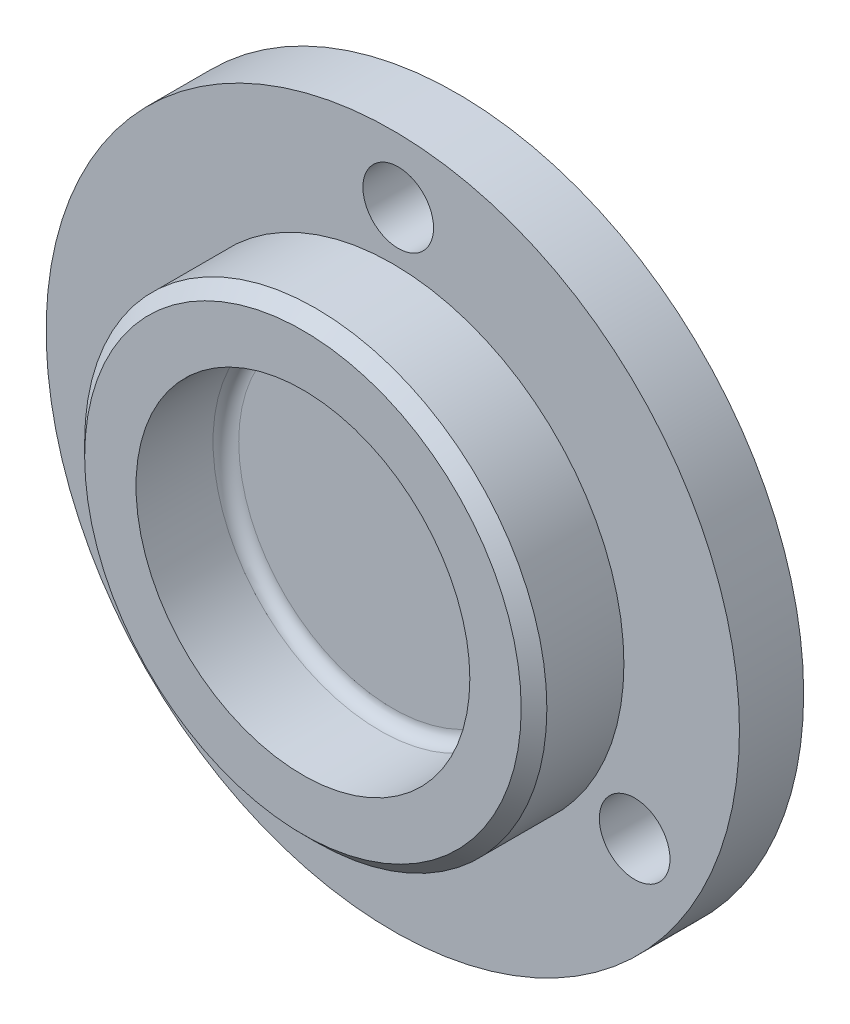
ISO-10303-21;
HEADER;
FILE_DESCRIPTION(('STEP AP214'),'2;1');
FILE_NAME('part.step','',(''),(''),'','','');
FILE_SCHEMA(('AUTOMOTIVE_DESIGN { 1 0 10303 214 1 1 1 1 }'));
ENDSEC;
DATA;
#1=APPLICATION_CONTEXT('core data for automotive mechanical design processes');
#2=APPLICATION_PROTOCOL_DEFINITION('international standard','automotive_design',2000,#1);
#3=PRODUCT_CONTEXT('',#1,'mechanical');
#4=PRODUCT('Part','Part','',(#3));
#5=PRODUCT_RELATED_PRODUCT_CATEGORY('part','',(#4));
#6=PRODUCT_DEFINITION_FORMATION('','',#4);
#7=PRODUCT_DEFINITION_CONTEXT('part definition',#1,'design');
#8=PRODUCT_DEFINITION('design','',#6,#7);
#9=PRODUCT_DEFINITION_SHAPE('','',#8);
#10=(LENGTH_UNIT() NAMED_UNIT(*) SI_UNIT(.MILLI.,.METRE.));
#11=(NAMED_UNIT(*) PLANE_ANGLE_UNIT() SI_UNIT($,.RADIAN.));
#12=(NAMED_UNIT(*) SI_UNIT($,.STERADIAN.) SOLID_ANGLE_UNIT());
#13=UNCERTAINTY_MEASURE_WITH_UNIT(LENGTH_MEASURE(1.E-05),#10,'distance_accuracy_value','');
#14=(GEOMETRIC_REPRESENTATION_CONTEXT(3) GLOBAL_UNCERTAINTY_ASSIGNED_CONTEXT((#13)) GLOBAL_UNIT_ASSIGNED_CONTEXT((#10,
#11,#12)) REPRESENTATION_CONTEXT('',''));
#15=CARTESIAN_POINT('',(0.,0.,0.));
#16=DIRECTION('',(0.,0.,1.));
#17=DIRECTION('',(1.,0.,0.));
#18=AXIS2_PLACEMENT_3D('',#15,#16,#17);
#19=CARTESIAN_POINT('',(0.,0.,5.));
#20=DIRECTION('',(0.,0.,1.));
#21=DIRECTION('',(1.,0.,0.));
#22=AXIS2_PLACEMENT_3D('',#19,#20,#21);
#23=PLANE('',#22);
#24=CARTESIAN_POINT('',(-19.260536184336,-10.6316389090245,5.));
#25=DIRECTION('',(0.,0.,1.));
#26=DIRECTION('',(1.,0.,0.));
#27=AXIS2_PLACEMENT_3D('',#24,#25,#26);
#28=CIRCLE('',#27,2.75);
#29=CARTESIAN_POINT('',(-16.510536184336,-10.6316389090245,5.));
#30=VERTEX_POINT('',#29);
#31=EDGE_CURVE('E73',#30,#30,#28,.T.);
#32=ORIENTED_EDGE('',*,*,#31,.F.);
#33=EDGE_LOOP('',(#32));
#34=FACE_BOUND('',#33,.T.);
#35=CARTESIAN_POINT('',(18.8375374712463,-11.3642941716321,5.));
#36=DIRECTION('',(0.,0.,1.));
#37=DIRECTION('',(1.,0.,0.));
#38=AXIS2_PLACEMENT_3D('',#35,#36,#37);
#39=CIRCLE('',#38,2.75);
#40=CARTESIAN_POINT('',(21.5875374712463,-11.3642941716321,5.));
#41=VERTEX_POINT('',#40);
#42=EDGE_CURVE('E67',#41,#41,#39,.T.);
#43=ORIENTED_EDGE('',*,*,#42,.F.);
#44=EDGE_LOOP('',(#43));
#45=FACE_BOUND('',#44,.T.);
#46=CARTESIAN_POINT('',(0.422998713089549,21.9959330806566,5.));
#47=DIRECTION('',(0.,0.,1.));
#48=DIRECTION('',(1.,0.,0.));
#49=AXIS2_PLACEMENT_3D('',#46,#47,#48);
#50=CIRCLE('',#49,2.75);
#51=CARTESIAN_POINT('',(3.17299871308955,21.9959330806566,5.));
#52=VERTEX_POINT('',#51);
#53=EDGE_CURVE('E61',#52,#52,#50,.T.);
#54=ORIENTED_EDGE('',*,*,#53,.F.);
#55=EDGE_LOOP('',(#54));
#56=FACE_BOUND('',#55,.T.);
#57=CARTESIAN_POINT('',(0.,0.,5.));
#58=DIRECTION('',(0.,0.,1.));
#59=DIRECTION('',(1.,0.,0.));
#60=AXIS2_PLACEMENT_3D('',#57,#58,#59);
#61=CIRCLE('',#60,27.);
#62=CARTESIAN_POINT('',(27.,0.,5.));
#63=VERTEX_POINT('',#62);
#64=EDGE_CURVE('E49',#63,#63,#61,.T.);
#65=ORIENTED_EDGE('',*,*,#64,.T.);
#66=EDGE_LOOP('',(#65));
#67=FACE_BOUND('',#66,.T.);
#68=CARTESIAN_POINT('',(0.,0.,5.));
#69=DIRECTION('',(0.,0.,1.));
#70=DIRECTION('',(1.,0.,0.));
#71=AXIS2_PLACEMENT_3D('',#68,#69,#70);
#72=CIRCLE('',#71,18.);
#73=CARTESIAN_POINT('',(18.,0.,5.));
#74=VERTEX_POINT('',#73);
#75=EDGE_CURVE('E55',#74,#74,#72,.T.);
#76=ORIENTED_EDGE('',*,*,#75,.F.);
#77=EDGE_LOOP('',(#76));
#78=FACE_BOUND('',#77,.T.);
#79=ADVANCED_FACE('F29',(#34,#45,#56,#67,#78),#23,.T.);
#80=CARTESIAN_POINT('',(0.,0.,5.));
#81=DIRECTION('',(0.,0.,-1.));
#82=DIRECTION('',(-1.,0.,0.));
#83=AXIS2_PLACEMENT_3D('',#80,#81,#82);
#84=CYLINDRICAL_SURFACE('',#83,27.);
#85=ORIENTED_EDGE('',*,*,#64,.F.);
#86=EDGE_LOOP('',(#85));
#87=FACE_BOUND('',#86,.T.);
#88=CARTESIAN_POINT('',(0.,0.,0.));
#89=DIRECTION('',(0.,0.,1.));
#90=DIRECTION('',(1.,0.,0.));
#91=AXIS2_PLACEMENT_3D('',#88,#89,#90);
#92=CIRCLE('',#91,27.);
#93=CARTESIAN_POINT('',(27.,0.,0.));
#94=VERTEX_POINT('',#93);
#95=EDGE_CURVE('E52',#94,#94,#92,.T.);
#96=ORIENTED_EDGE('',*,*,#95,.T.);
#97=EDGE_LOOP('',(#96));
#98=FACE_BOUND('',#97,.T.);
#99=ADVANCED_FACE('F31',(#87,#98),#84,.T.);
#100=CARTESIAN_POINT('',(0.,0.,0.));
#101=DIRECTION('',(0.,0.,1.));
#102=DIRECTION('',(1.,0.,0.));
#103=AXIS2_PLACEMENT_3D('',#100,#101,#102);
#104=PLANE('',#103);
#105=CARTESIAN_POINT('',(-19.260536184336,-10.6316389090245,0.));
#106=DIRECTION('',(0.,0.,-1.));
#107=DIRECTION('',(-1.,0.,0.));
#108=AXIS2_PLACEMENT_3D('',#105,#106,#107);
#109=CIRCLE('',#108,2.75);
#110=CARTESIAN_POINT('',(-22.010536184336,-10.6316389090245,0.));
#111=VERTEX_POINT('',#110);
#112=EDGE_CURVE('E76',#111,#111,#109,.T.);
#113=ORIENTED_EDGE('',*,*,#112,.F.);
#114=EDGE_LOOP('',(#113));
#115=FACE_BOUND('',#114,.T.);
#116=CARTESIAN_POINT('',(18.8375374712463,-11.3642941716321,0.));
#117=DIRECTION('',(0.,0.,-1.));
#118=DIRECTION('',(-1.,0.,0.));
#119=AXIS2_PLACEMENT_3D('',#116,#117,#118);
#120=CIRCLE('',#119,2.75);
#121=CARTESIAN_POINT('',(16.0875374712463,-11.3642941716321,0.));
#122=VERTEX_POINT('',#121);
#123=EDGE_CURVE('E70',#122,#122,#120,.T.);
#124=ORIENTED_EDGE('',*,*,#123,.F.);
#125=EDGE_LOOP('',(#124));
#126=FACE_BOUND('',#125,.T.);
#127=CARTESIAN_POINT('',(0.422998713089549,21.9959330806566,0.));
#128=DIRECTION('',(0.,0.,-1.));
#129=DIRECTION('',(-1.,0.,0.));
#130=AXIS2_PLACEMENT_3D('',#127,#128,#129);
#131=CIRCLE('',#130,2.75);
#132=CARTESIAN_POINT('',(-2.32700128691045,21.9959330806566,0.));
#133=VERTEX_POINT('',#132);
#134=EDGE_CURVE('E64',#133,#133,#131,.T.);
#135=ORIENTED_EDGE('',*,*,#134,.F.);
#136=EDGE_LOOP('',(#135));
#137=FACE_BOUND('',#136,.T.);
#138=ORIENTED_EDGE('',*,*,#95,.F.);
#139=EDGE_LOOP('',(#138));
#140=FACE_BOUND('',#139,.T.);
#141=ADVANCED_FACE('F82',(#115,#126,#137,#140),#104,.F.);
#142=CARTESIAN_POINT('',(0.,0.,12.));
#143=DIRECTION('',(0.,0.,-1.));
#144=DIRECTION('',(-1.,0.,0.));
#145=AXIS2_PLACEMENT_3D('',#142,#143,#144);
#146=CYLINDRICAL_SURFACE('',#145,18.);
#147=CARTESIAN_POINT('',(0.,0.,11.));
#148=DIRECTION('',(0.,0.,1.));
#149=DIRECTION('',(1.,0.,0.));
#150=AXIS2_PLACEMENT_3D('',#147,#148,#149);
#151=CIRCLE('',#150,18.);
#152=CARTESIAN_POINT('',(18.,0.,11.));
#153=VERTEX_POINT('',#152);
#154=EDGE_CURVE('E10',#153,#153,#151,.F.);
#155=ORIENTED_EDGE('',*,*,#154,.T.);
#156=EDGE_LOOP('',(#155));
#157=FACE_BOUND('',#156,.T.);
#158=ORIENTED_EDGE('',*,*,#75,.T.);
#159=EDGE_LOOP('',(#158));
#160=FACE_BOUND('',#159,.T.);
#161=ADVANCED_FACE('F85',(#157,#160),#146,.T.);
#162=CARTESIAN_POINT('',(0.,0.,12.));
#163=DIRECTION('',(0.,0.,1.));
#164=DIRECTION('',(1.,0.,0.));
#165=AXIS2_PLACEMENT_3D('',#162,#163,#164);
#166=PLANE('',#165);
#167=CARTESIAN_POINT('',(0.,0.,12.));
#168=DIRECTION('',(0.,0.,1.));
#169=DIRECTION('',(1.,0.,0.));
#170=AXIS2_PLACEMENT_3D('',#167,#168,#169);
#171=CIRCLE('',#170,17.);
#172=CARTESIAN_POINT('',(17.,0.,12.));
#173=VERTEX_POINT('',#172);
#174=EDGE_CURVE('E36',#173,#173,#171,.T.);
#175=ORIENTED_EDGE('',*,*,#174,.T.);
#176=EDGE_LOOP('',(#175));
#177=FACE_BOUND('',#176,.T.);
#178=CARTESIAN_POINT('',(0.,0.,12.));
#179=DIRECTION('',(0.,0.,1.));
#180=DIRECTION('',(1.,0.,0.));
#181=AXIS2_PLACEMENT_3D('',#178,#179,#180);
#182=CIRCLE('',#181,13.);
#183=CARTESIAN_POINT('',(13.,0.,12.));
#184=VERTEX_POINT('',#183);
#185=EDGE_CURVE('E58',#184,#184,#182,.T.);
#186=ORIENTED_EDGE('',*,*,#185,.F.);
#187=EDGE_LOOP('',(#186));
#188=FACE_BOUND('',#187,.T.);
#189=ADVANCED_FACE('F106',(#177,#188),#166,.T.);
#190=CARTESIAN_POINT('',(0.,0.,5.));
#191=DIRECTION('',(0.,0.,1.));
#192=DIRECTION('',(1.,0.,0.));
#193=AXIS2_PLACEMENT_3D('',#190,#191,#192);
#194=CYLINDRICAL_SURFACE('',#193,13.);
#195=CARTESIAN_POINT('',(0.,0.,6.));
#196=DIRECTION('',(0.,0.,1.));
#197=DIRECTION('',(1.,0.,0.));
#198=AXIS2_PLACEMENT_3D('',#195,#196,#197);
#199=CIRCLE('',#198,13.);
#200=CARTESIAN_POINT('',(13.,0.,6.));
#201=VERTEX_POINT('',#200);
#202=EDGE_CURVE('E40',#201,#201,#199,.F.);
#203=ORIENTED_EDGE('',*,*,#202,.T.);
#204=EDGE_LOOP('',(#203));
#205=FACE_BOUND('',#204,.T.);
#206=ORIENTED_EDGE('',*,*,#185,.T.);
#207=EDGE_LOOP('',(#206));
#208=FACE_BOUND('',#207,.T.);
#209=ADVANCED_FACE('F112',(#205,#208),#194,.F.);
#210=CARTESIAN_POINT('',(0.,0.,5.));
#211=DIRECTION('',(0.,0.,1.));
#212=DIRECTION('',(1.,0.,0.));
#213=AXIS2_PLACEMENT_3D('',#210,#211,#212);
#214=PLANE('',#213);
#215=CARTESIAN_POINT('',(0.,0.,5.));
#216=DIRECTION('',(0.,0.,1.));
#217=DIRECTION('',(1.,0.,0.));
#218=AXIS2_PLACEMENT_3D('',#215,#216,#217);
#219=CIRCLE('',#218,12.);
#220=CARTESIAN_POINT('',(12.,0.,5.));
#221=VERTEX_POINT('',#220);
#222=EDGE_CURVE('E44',#221,#221,#219,.T.);
#223=ORIENTED_EDGE('',*,*,#222,.T.);
#224=EDGE_LOOP('',(#223));
#225=FACE_BOUND('',#224,.T.);
#226=ADVANCED_FACE('F116',(#225),#214,.T.);
#227=CARTESIAN_POINT('',(0.,0.,6.));
#228=DIRECTION('',(0.,0.,1.));
#229=DIRECTION('',(1.,0.,0.));
#230=AXIS2_PLACEMENT_3D('',#227,#228,#229);
#231=TOROIDAL_SURFACE('',#230,12.,1.);
#232=ORIENTED_EDGE('',*,*,#202,.F.);
#233=EDGE_LOOP('',(#232));
#234=FACE_BOUND('',#233,.T.);
#235=ORIENTED_EDGE('',*,*,#222,.F.);
#236=EDGE_LOOP('',(#235));
#237=FACE_BOUND('',#236,.T.);
#238=ADVANCED_FACE('F120',(#234,#237),#231,.F.);
#239=CARTESIAN_POINT('',(0.422998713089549,21.9959330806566,0.));
#240=DIRECTION('',(0.,0.,-1.));
#241=DIRECTION('',(-1.,0.,0.));
#242=AXIS2_PLACEMENT_3D('',#239,#240,#241);
#243=CYLINDRICAL_SURFACE('',#242,2.75);
#244=ORIENTED_EDGE('',*,*,#53,.T.);
#245=EDGE_LOOP('',(#244));
#246=FACE_BOUND('',#245,.T.);
#247=ORIENTED_EDGE('',*,*,#134,.T.);
#248=EDGE_LOOP('',(#247));
#249=FACE_BOUND('',#248,.T.);
#250=ADVANCED_FACE('F124',(#246,#249),#243,.F.);
#251=CARTESIAN_POINT('',(18.8375374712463,-11.3642941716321,0.));
#252=DIRECTION('',(0.,0.,-1.));
#253=DIRECTION('',(-1.,0.,0.));
#254=AXIS2_PLACEMENT_3D('',#251,#252,#253);
#255=CYLINDRICAL_SURFACE('',#254,2.75);
#256=ORIENTED_EDGE('',*,*,#42,.T.);
#257=EDGE_LOOP('',(#256));
#258=FACE_BOUND('',#257,.T.);
#259=ORIENTED_EDGE('',*,*,#123,.T.);
#260=EDGE_LOOP('',(#259));
#261=FACE_BOUND('',#260,.T.);
#262=ADVANCED_FACE('F128',(#258,#261),#255,.F.);
#263=CARTESIAN_POINT('',(-19.260536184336,-10.6316389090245,0.));
#264=DIRECTION('',(0.,0.,-1.));
#265=DIRECTION('',(-1.,0.,0.));
#266=AXIS2_PLACEMENT_3D('',#263,#264,#265);
#267=CYLINDRICAL_SURFACE('',#266,2.75);
#268=ORIENTED_EDGE('',*,*,#31,.T.);
#269=EDGE_LOOP('',(#268));
#270=FACE_BOUND('',#269,.T.);
#271=ORIENTED_EDGE('',*,*,#112,.T.);
#272=EDGE_LOOP('',(#271));
#273=FACE_BOUND('',#272,.T.);
#274=ADVANCED_FACE('F80',(#270,#273),#267,.F.);
#275=CARTESIAN_POINT('',(0.,0.,12.));
#276=DIRECTION('',(0.,0.,-1.));
#277=DIRECTION('',(-1.,0.,0.));
#278=AXIS2_PLACEMENT_3D('',#275,#276,#277);
#279=CONICAL_SURFACE('',#278,17.,0.785398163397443);
#280=ORIENTED_EDGE('',*,*,#154,.F.);
#281=EDGE_LOOP('',(#280));
#282=FACE_BOUND('',#281,.T.);
#283=ORIENTED_EDGE('',*,*,#174,.F.);
#284=EDGE_LOOP('',(#283));
#285=FACE_BOUND('',#284,.T.);
#286=ADVANCED_FACE('F134',(#282,#285),#279,.T.);
#287=CLOSED_SHELL('',(#79,#99,#141,#161,#189,#209,#226,#238,#250,#262,#274,#286));
#288=MANIFOLD_SOLID_BREP('B2',#287);
#289=ADVANCED_BREP_SHAPE_REPRESENTATION('',(#18,#288),#14);
#290=SHAPE_DEFINITION_REPRESENTATION(#9,#289);
ENDSEC;
END-ISO-10303-21;
